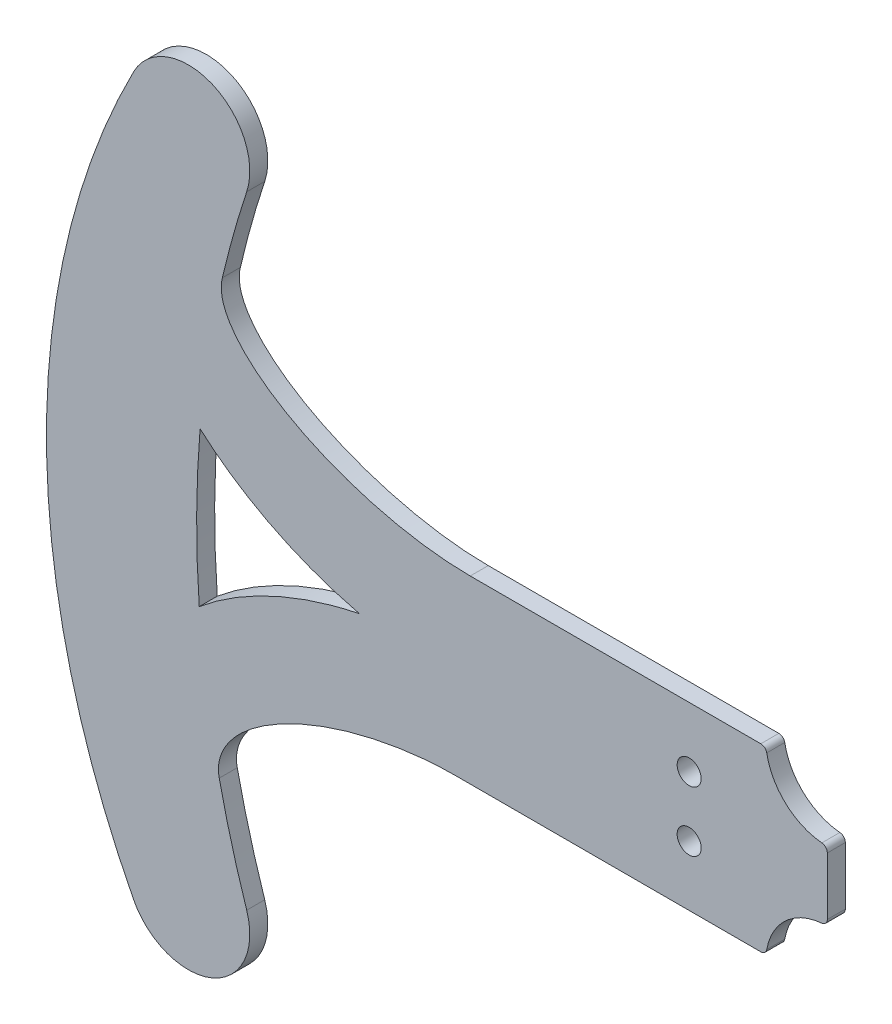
from build123d import *

# Parameters (mm, degrees)
ESQUISSE2_R      = 2
EXTRUSION2_DEPTH = 3


with BuildPart() as part:
    # Esquisse2 → Extrusion2 (new body)
    with BuildSketch(Plane.XY):
        with BuildLine():
            Line((-59.451213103, 15), (-11.070794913, 15))
            ThreePointArc((-11.070794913, 15), (-10.429615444, 14.767390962), (-10.086724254, 14.177777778))
            ThreePointArc((-10.086724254, 14.177777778), (-6.915518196, 8.434412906), (-0.911111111, 5.790574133))
            ThreePointArc((-0.911111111, 5.790574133), (-0.262135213, 5.469481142), (0, 4.794532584))
            Line((0, 4.794532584), (0, -4.794532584))
            ThreePointArc((0, -4.794532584), (-0.262135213, -5.469481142), (-0.911111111, -5.790574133))
            ThreePointArc((-0.911111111, -5.790574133), (-6.915518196, -8.434412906), (-10.086724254, -14.177777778))
            ThreePointArc((-10.086724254, -14.177777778), (-10.429615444, -14.767390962), (-11.070794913, -15))
            Line((-11.070794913, -15), (-61.804318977, -15))
            add(Edge.make_bspline(
                [(-61.804318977, -15), (-105.590966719, -15), (-101.237477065, -35.035353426)],
                knots=[4.278773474, 4.278773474, 4.278773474, 6.290100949, 6.290100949, 6.290100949], degree=2, weights=[1, 0.535527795, 1]))
            ThreePointArc((-101.237477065, -35.035353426), (-99.170554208, -43.471078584), (-96.662609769, -51.786356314))
            ThreePointArc((-96.662609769, -51.786356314), (-102.414072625, -64.438092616), (-115.479999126, -59.702343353))
            ThreePointArc((-115.479999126, -59.702343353), (-130, 0), (-115.479999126, 59.702343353))
            ThreePointArc((-115.479999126, 59.702343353), (-102.414072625, 64.438092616), (-96.662609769, 51.786356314))
            ThreePointArc((-96.662609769, 51.786356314), (-98.850963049, 44.624786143), (-100.712121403, 37.371299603))
            add(Edge.make_bspline(
                [(-100.712121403, 37.371299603), (-106.615454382, 15), (-59.451213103, 15)],
                knots=[0, 0, 0, 2.11777312, 2.11777312, 2.11777312], degree=2, weights=[1, 0.489843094, 1]))
        make_face()
        with Locations((-23, 5)):
            Circle(ESQUISSE2_R, mode=Mode.SUBTRACT)
        with Locations((-23, -5)):
            Circle(ESQUISSE2_R, mode=Mode.SUBTRACT)
        with BuildLine():
            ThreePointArc((-104.426529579, 13.744685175), (-104.997595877, 0.890704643), (-104.565337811, -11.968692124))
            add(Edge.make_bspline(
                [(-77.88744289, 0.338878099), (-93.68669017, -2.866383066), (-104.565337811, -11.968692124)],
                knots=[1.574041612, 1.574041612, 1.574041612, 2.258525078, 2.258525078, 2.258525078], degree=2, weights=[1, 0.942004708, 1]))
            add(Edge.make_bspline(
                [(-104.426529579, 13.744685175), (-93.657360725, 4.127093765), (-77.88744289, 0.338878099)],
                knots=[4.057438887, 4.057438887, 4.057438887, 4.745939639, 4.745939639, 4.745939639], degree=2, weights=[1, 0.941328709, 1]))
        make_face(mode=Mode.SUBTRACT)
    extrude(amount=EXTRUSION2_DEPTH)


solid = part.part
